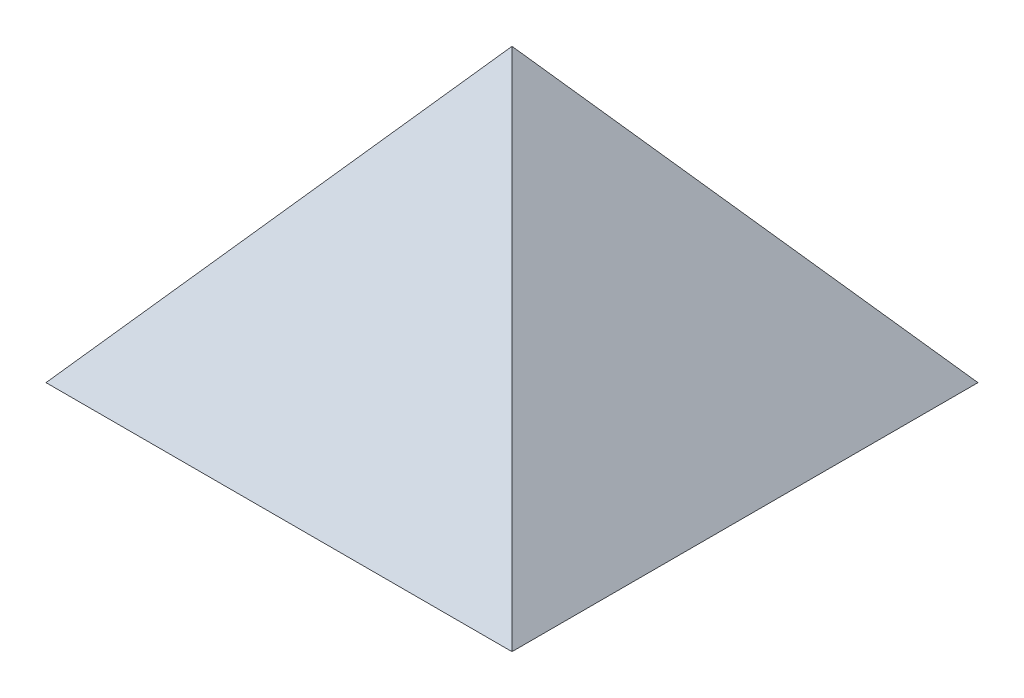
ISO-10303-21;
HEADER;
FILE_DESCRIPTION(('STEP AP214'),'2;1');
FILE_NAME('part.step','',(''),(''),'','','');
FILE_SCHEMA(('AUTOMOTIVE_DESIGN { 1 0 10303 214 1 1 1 1 }'));
ENDSEC;
DATA;
#1=APPLICATION_CONTEXT('core data for automotive mechanical design processes');
#2=APPLICATION_PROTOCOL_DEFINITION('international standard','automotive_design',2000,#1);
#3=PRODUCT_CONTEXT('',#1,'mechanical');
#4=PRODUCT('Part','Part','',(#3));
#5=PRODUCT_RELATED_PRODUCT_CATEGORY('part','',(#4));
#6=PRODUCT_DEFINITION_FORMATION('','',#4);
#7=PRODUCT_DEFINITION_CONTEXT('part definition',#1,'design');
#8=PRODUCT_DEFINITION('design','',#6,#7);
#9=PRODUCT_DEFINITION_SHAPE('','',#8);
#10=(LENGTH_UNIT() NAMED_UNIT(*) SI_UNIT(.MILLI.,.METRE.));
#11=(NAMED_UNIT(*) PLANE_ANGLE_UNIT() SI_UNIT($,.RADIAN.));
#12=(NAMED_UNIT(*) SI_UNIT($,.STERADIAN.) SOLID_ANGLE_UNIT());
#13=UNCERTAINTY_MEASURE_WITH_UNIT(LENGTH_MEASURE(1.E-05),#10,'distance_accuracy_value','');
#14=(GEOMETRIC_REPRESENTATION_CONTEXT(3) GLOBAL_UNCERTAINTY_ASSIGNED_CONTEXT((#13)) GLOBAL_UNIT_ASSIGNED_CONTEXT((#10,
#11,#12)) REPRESENTATION_CONTEXT('',''));
#15=CARTESIAN_POINT('',(0.,0.,0.));
#16=DIRECTION('',(0.,0.,1.));
#17=DIRECTION('',(1.,0.,0.));
#18=AXIS2_PLACEMENT_3D('',#15,#16,#17);
#19=CARTESIAN_POINT('',(-40.,0.,-40.));
#20=DIRECTION('',(0.,-1.,0.));
#21=DIRECTION('',(0.,0.,-1.));
#22=AXIS2_PLACEMENT_3D('',#19,#20,#21);
#23=PLANE('',#22);
#24=DIRECTION('',(0.,0.,1.));
#25=VECTOR('',#24,1.);
#26=CARTESIAN_POINT('',(-40.,0.,40.));
#27=LINE('',#26,#25);
#28=CARTESIAN_POINT('',(-40.,0.,-40.));
#29=VERTEX_POINT('',#28);
#30=CARTESIAN_POINT('',(-40.,0.,40.));
#31=VERTEX_POINT('',#30);
#32=EDGE_CURVE('E70',#29,#31,#27,.T.);
#33=ORIENTED_EDGE('',*,*,#32,.F.);
#34=DIRECTION('',(-1.,0.,0.));
#35=VECTOR('',#34,1.);
#36=CARTESIAN_POINT('',(-40.,0.,-40.));
#37=LINE('',#36,#35);
#38=CARTESIAN_POINT('',(40.,0.,-40.));
#39=VERTEX_POINT('',#38);
#40=EDGE_CURVE('E84',#39,#29,#37,.T.);
#41=ORIENTED_EDGE('',*,*,#40,.F.);
#42=DIRECTION('',(0.,0.,-1.));
#43=VECTOR('',#42,1.);
#44=CARTESIAN_POINT('',(40.,0.,40.));
#45=LINE('',#44,#43);
#46=CARTESIAN_POINT('',(40.,0.,40.));
#47=VERTEX_POINT('',#46);
#48=EDGE_CURVE('E48',#47,#39,#45,.T.);
#49=ORIENTED_EDGE('',*,*,#48,.F.);
#50=DIRECTION('',(1.,0.,0.));
#51=VECTOR('',#50,1.);
#52=CARTESIAN_POINT('',(-40.,0.,40.));
#53=LINE('',#52,#51);
#54=EDGE_CURVE('E12',#31,#47,#53,.T.);
#55=ORIENTED_EDGE('',*,*,#54,.F.);
#56=EDGE_LOOP('',(#33,#41,#49,#55));
#57=FACE_BOUND('',#56,.T.);
#58=ADVANCED_FACE('F35',(#57),#23,.T.);
#59=CARTESIAN_POINT('',(0.,50.,0.));
#60=DIRECTION('',(-0.78086880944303,-0.624695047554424,0.));
#61=DIRECTION('',(0.624695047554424,-0.78086880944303,0.));
#62=AXIS2_PLACEMENT_3D('',#59,#60,#61);
#63=PLANE('',#62);
#64=DIRECTION('',(-0.529812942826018,0.662266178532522,0.529812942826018));
#65=VECTOR('',#64,1.);
#66=CARTESIAN_POINT('',(40.,0.,-40.));
#67=LINE('',#66,#65);
#68=CARTESIAN_POINT('',(0.,50.,0.));
#69=VERTEX_POINT('',#68);
#70=EDGE_CURVE('E71',#39,#69,#67,.T.);
#71=ORIENTED_EDGE('',*,*,#70,.T.);
#72=DIRECTION('',(-0.529812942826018,0.662266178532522,-0.529812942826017));
#73=VECTOR('',#72,1.);
#74=CARTESIAN_POINT('',(40.,0.,40.));
#75=LINE('',#74,#73);
#76=EDGE_CURVE('E57',#47,#69,#75,.T.);
#77=ORIENTED_EDGE('',*,*,#76,.F.);
#78=ORIENTED_EDGE('',*,*,#48,.T.);
#79=EDGE_LOOP('',(#71,#77,#78));
#80=FACE_BOUND('',#79,.T.);
#81=ADVANCED_FACE('F75',(#80),#63,.F.);
#82=CARTESIAN_POINT('',(0.,50.,0.));
#83=DIRECTION('',(0.,-0.624695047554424,-0.78086880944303));
#84=DIRECTION('',(0.,0.78086880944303,-0.624695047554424));
#85=AXIS2_PLACEMENT_3D('',#82,#83,#84);
#86=PLANE('',#85);
#87=ORIENTED_EDGE('',*,*,#76,.T.);
#88=DIRECTION('',(0.529812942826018,0.662266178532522,-0.529812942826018));
#89=VECTOR('',#88,1.);
#90=CARTESIAN_POINT('',(-40.,0.,40.));
#91=LINE('',#90,#89);
#92=EDGE_CURVE('E67',#31,#69,#91,.T.);
#93=ORIENTED_EDGE('',*,*,#92,.F.);
#94=ORIENTED_EDGE('',*,*,#54,.T.);
#95=EDGE_LOOP('',(#87,#93,#94));
#96=FACE_BOUND('',#95,.T.);
#97=ADVANCED_FACE('F65',(#96),#86,.F.);
#98=CARTESIAN_POINT('',(0.,50.,0.));
#99=DIRECTION('',(0.,-0.624695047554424,0.78086880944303));
#100=DIRECTION('',(0.,-0.78086880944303,-0.624695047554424));
#101=AXIS2_PLACEMENT_3D('',#98,#99,#100);
#102=PLANE('',#101);
#103=DIRECTION('',(0.529812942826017,0.662266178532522,0.529812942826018));
#104=VECTOR('',#103,1.);
#105=CARTESIAN_POINT('',(-40.,0.,-40.));
#106=LINE('',#105,#104);
#107=EDGE_CURVE('E80',#29,#69,#106,.T.);
#108=ORIENTED_EDGE('',*,*,#107,.T.);
#109=ORIENTED_EDGE('',*,*,#70,.F.);
#110=ORIENTED_EDGE('',*,*,#40,.T.);
#111=EDGE_LOOP('',(#108,#109,#110));
#112=FACE_BOUND('',#111,.T.);
#113=ADVANCED_FACE('F83',(#112),#102,.F.);
#114=CARTESIAN_POINT('',(0.,50.,0.));
#115=DIRECTION('',(0.78086880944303,-0.624695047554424,0.));
#116=DIRECTION('',(0.624695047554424,0.78086880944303,0.));
#117=AXIS2_PLACEMENT_3D('',#114,#115,#116);
#118=PLANE('',#117);
#119=ORIENTED_EDGE('',*,*,#92,.T.);
#120=ORIENTED_EDGE('',*,*,#107,.F.);
#121=ORIENTED_EDGE('',*,*,#32,.T.);
#122=EDGE_LOOP('',(#119,#120,#121));
#123=FACE_BOUND('',#122,.T.);
#124=ADVANCED_FACE('F37',(#123),#118,.F.);
#125=CLOSED_SHELL('',(#58,#81,#97,#113,#124));
#126=MANIFOLD_SOLID_BREP('B2',#125);
#127=ADVANCED_BREP_SHAPE_REPRESENTATION('',(#18,#126),#14);
#128=SHAPE_DEFINITION_REPRESENTATION(#9,#127);
ENDSEC;
END-ISO-10303-21;
